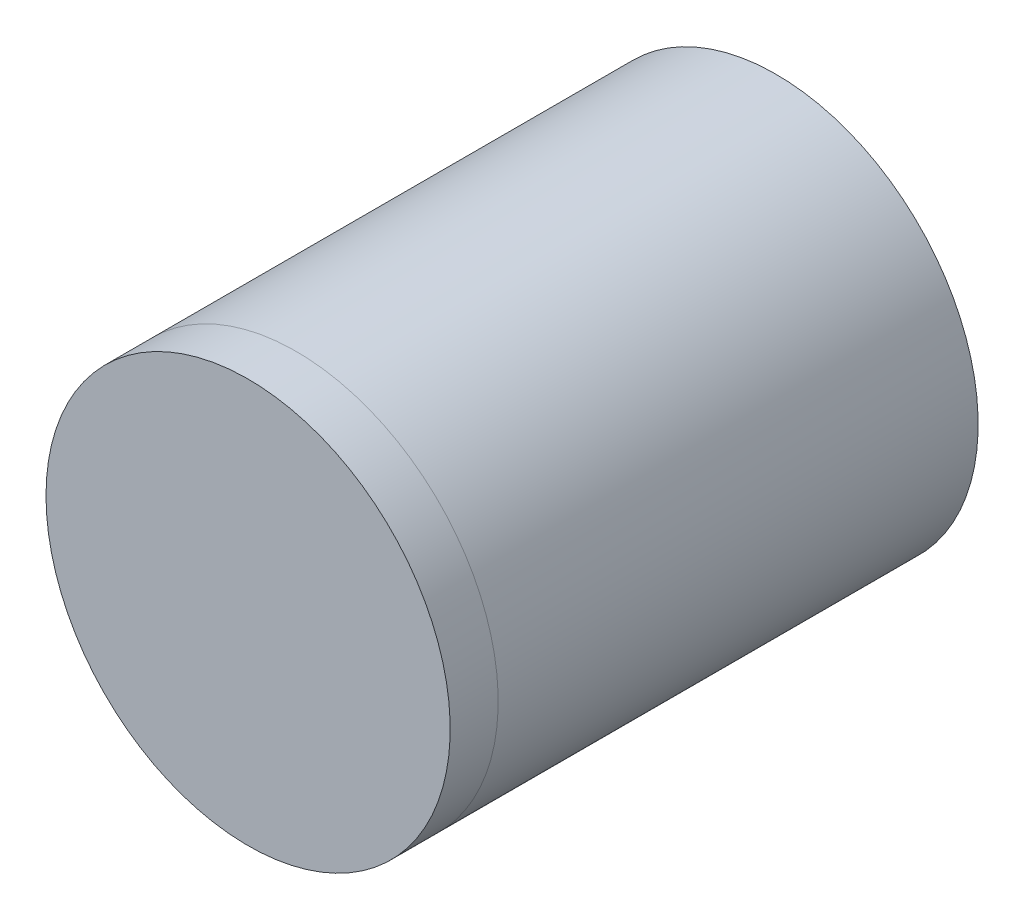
ISO-10303-21;
HEADER;
FILE_DESCRIPTION(('STEP AP214'),'2;1');
FILE_NAME('part.step','',(''),(''),'','','');
FILE_SCHEMA(('AUTOMOTIVE_DESIGN { 1 0 10303 214 1 1 1 1 }'));
ENDSEC;
DATA;
#1=APPLICATION_CONTEXT('core data for automotive mechanical design processes');
#2=APPLICATION_PROTOCOL_DEFINITION('international standard','automotive_design',2000,#1);
#3=PRODUCT_CONTEXT('',#1,'mechanical');
#4=PRODUCT('Part','Part','',(#3));
#5=PRODUCT_RELATED_PRODUCT_CATEGORY('part','',(#4));
#6=PRODUCT_DEFINITION_FORMATION('','',#4);
#7=PRODUCT_DEFINITION_CONTEXT('part definition',#1,'design');
#8=PRODUCT_DEFINITION('design','',#6,#7);
#9=PRODUCT_DEFINITION_SHAPE('','',#8);
#10=(LENGTH_UNIT() NAMED_UNIT(*) SI_UNIT(.MILLI.,.METRE.));
#11=(NAMED_UNIT(*) PLANE_ANGLE_UNIT() SI_UNIT($,.RADIAN.));
#12=(NAMED_UNIT(*) SI_UNIT($,.STERADIAN.) SOLID_ANGLE_UNIT());
#13=UNCERTAINTY_MEASURE_WITH_UNIT(LENGTH_MEASURE(1.E-05),#10,'distance_accuracy_value','');
#14=(GEOMETRIC_REPRESENTATION_CONTEXT(3) GLOBAL_UNCERTAINTY_ASSIGNED_CONTEXT((#13)) GLOBAL_UNIT_ASSIGNED_CONTEXT((#10,
#11,#12)) REPRESENTATION_CONTEXT('',''));
#15=CARTESIAN_POINT('',(0.,0.,0.));
#16=DIRECTION('',(0.,0.,1.));
#17=DIRECTION('',(1.,0.,0.));
#18=AXIS2_PLACEMENT_3D('',#15,#16,#17);
#19=CARTESIAN_POINT('',(0.,0.,20.899));
#20=DIRECTION('',(0.,0.,-1.));
#21=DIRECTION('',(-1.,0.,0.));
#22=AXIS2_PLACEMENT_3D('',#19,#20,#21);
#23=PLANE('',#22);
#24=CARTESIAN_POINT('',(0.,0.,20.899));
#25=DIRECTION('',(0.,0.,-1.));
#26=DIRECTION('',(-1.,0.,0.));
#27=AXIS2_PLACEMENT_3D('',#24,#25,#26);
#28=CIRCLE('',#27,8.0005);
#29=CARTESIAN_POINT('',(-8.0005,0.,20.899));
#30=VERTEX_POINT('',#29);
#31=EDGE_CURVE('E10',#30,#30,#28,.T.);
#32=ORIENTED_EDGE('',*,*,#31,.F.);
#33=EDGE_LOOP('',(#32));
#34=FACE_BOUND('',#33,.T.);
#35=ADVANCED_FACE('F28',(#34),#23,.F.);
#36=CARTESIAN_POINT('',(0.,0.,0.));
#37=DIRECTION('',(0.,0.,-1.));
#38=DIRECTION('',(-1.,0.,0.));
#39=AXIS2_PLACEMENT_3D('',#36,#37,#38);
#40=CYLINDRICAL_SURFACE('',#39,8.0005);
#41=CARTESIAN_POINT('',(0.,0.,18.999));
#42=DIRECTION('',(0.,0.,-1.));
#43=DIRECTION('',(-1.,0.,0.));
#44=AXIS2_PLACEMENT_3D('',#41,#42,#43);
#45=CIRCLE('',#44,8.);
#46=CARTESIAN_POINT('',(-8.,0.,18.999));
#47=VERTEX_POINT('',#46);
#48=EDGE_CURVE('E36',#47,#47,#45,.T.);
#49=ORIENTED_EDGE('',*,*,#48,.F.);
#50=EDGE_LOOP('',(#49));
#51=FACE_BOUND('',#50,.T.);
#52=ORIENTED_EDGE('',*,*,#31,.T.);
#53=EDGE_LOOP('',(#52));
#54=FACE_BOUND('',#53,.T.);
#55=ADVANCED_FACE('F49',(#51,#54),#40,.T.);
#56=CARTESIAN_POINT('',(0.,0.,-0.00100000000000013));
#57=DIRECTION('',(0.,0.,-1.));
#58=DIRECTION('',(-1.,0.,0.));
#59=AXIS2_PLACEMENT_3D('',#56,#57,#58);
#60=CYLINDRICAL_SURFACE('',#59,8.);
#61=CARTESIAN_POINT('',(0.,0.,-0.000999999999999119));
#62=DIRECTION('',(0.,0.,-1.));
#63=DIRECTION('',(-1.,0.,0.));
#64=AXIS2_PLACEMENT_3D('',#61,#62,#63);
#65=CIRCLE('',#64,8.);
#66=CARTESIAN_POINT('',(-8.,0.,-0.000999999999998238));
#67=VERTEX_POINT('',#66);
#68=EDGE_CURVE('E41',#67,#67,#65,.T.);
#69=ORIENTED_EDGE('',*,*,#68,.F.);
#70=EDGE_LOOP('',(#69));
#71=FACE_BOUND('',#70,.T.);
#72=ORIENTED_EDGE('',*,*,#48,.T.);
#73=EDGE_LOOP('',(#72));
#74=FACE_BOUND('',#73,.T.);
#75=ADVANCED_FACE('F51',(#71,#74),#60,.T.);
#76=CARTESIAN_POINT('',(0.,0.,-0.000999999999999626));
#77=DIRECTION('',(0.,0.,1.));
#78=DIRECTION('',(1.,0.,0.));
#79=AXIS2_PLACEMENT_3D('',#76,#77,#78);
#80=PLANE('',#79);
#81=ORIENTED_EDGE('',*,*,#68,.T.);
#82=EDGE_LOOP('',(#81));
#83=FACE_BOUND('',#82,.T.);
#84=ADVANCED_FACE('F56',(#83),#80,.F.);
#85=CLOSED_SHELL('',(#35,#55,#75,#84));
#86=MANIFOLD_SOLID_BREP('B2',#85);
#87=ADVANCED_BREP_SHAPE_REPRESENTATION('',(#18,#86),#14);
#88=SHAPE_DEFINITION_REPRESENTATION(#9,#87);
ENDSEC;
END-ISO-10303-21;
